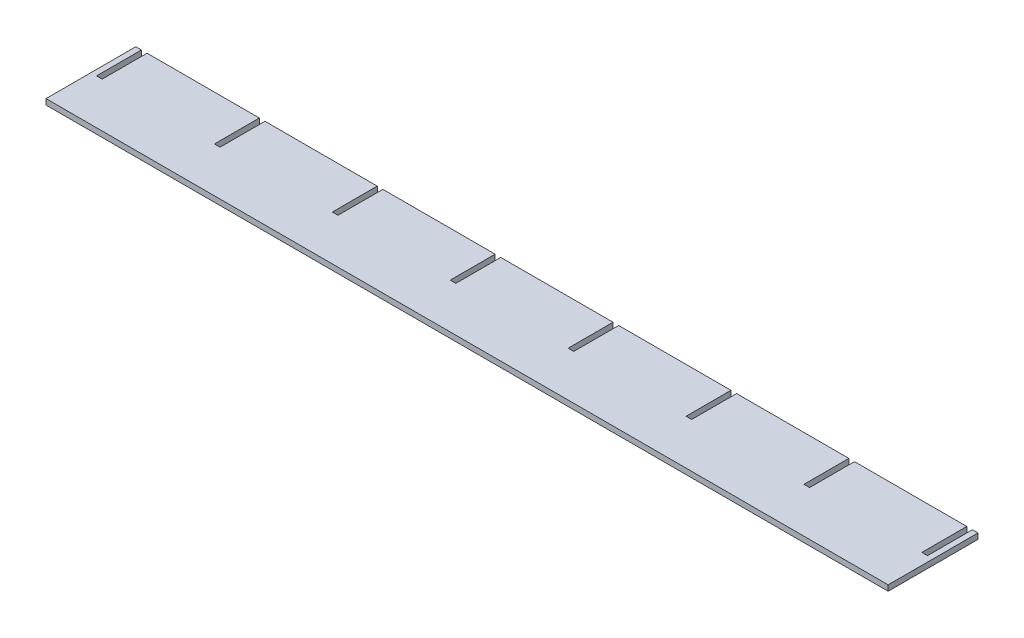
from build123d import *

# Parameters (mm, degrees)
BOSS_EXTRUDE2_DEPTH = 6.35


with BuildPart() as part:
    # Sketch2 → Boss-Extrude2 (new body)
    with BuildSketch(Plane(origin=(0, 0, 0), x_dir=(1, 0, 0), z_dir=(0, 1, 0))):
        Polygon((0, 0), (0, 101.6), (6.35, 101.6), (6.35, 50.8), (12.7, 50.8), (12.7, 101.6), (139.7, 101.6), (139.7, 50.8), (146.05, 50.8), (146.05, 101.6), (273.05, 101.6), (273.05, 50.8), (279.4, 50.8), (279.4, 101.6), (406.4, 101.6), (406.4, 50.8), (412.75, 50.8), (412.75, 101.6), (539.75, 101.6), (539.75, 50.8), (546.1, 50.8), (546.1, 101.6), (673.1, 101.6), (673.1, 50.8), (679.45, 50.8), (679.45, 101.6), (806.45, 101.6), (806.45, 50.8), (812.8, 50.8), (812.8, 101.6), (939.8, 101.6), (939.8, 50.8), (946.15, 50.8), (946.15, 101.6), (952.5, 101.6), (952.5, 0), align=None)
    extrude(amount=BOSS_EXTRUDE2_DEPTH)


solid = part.part
